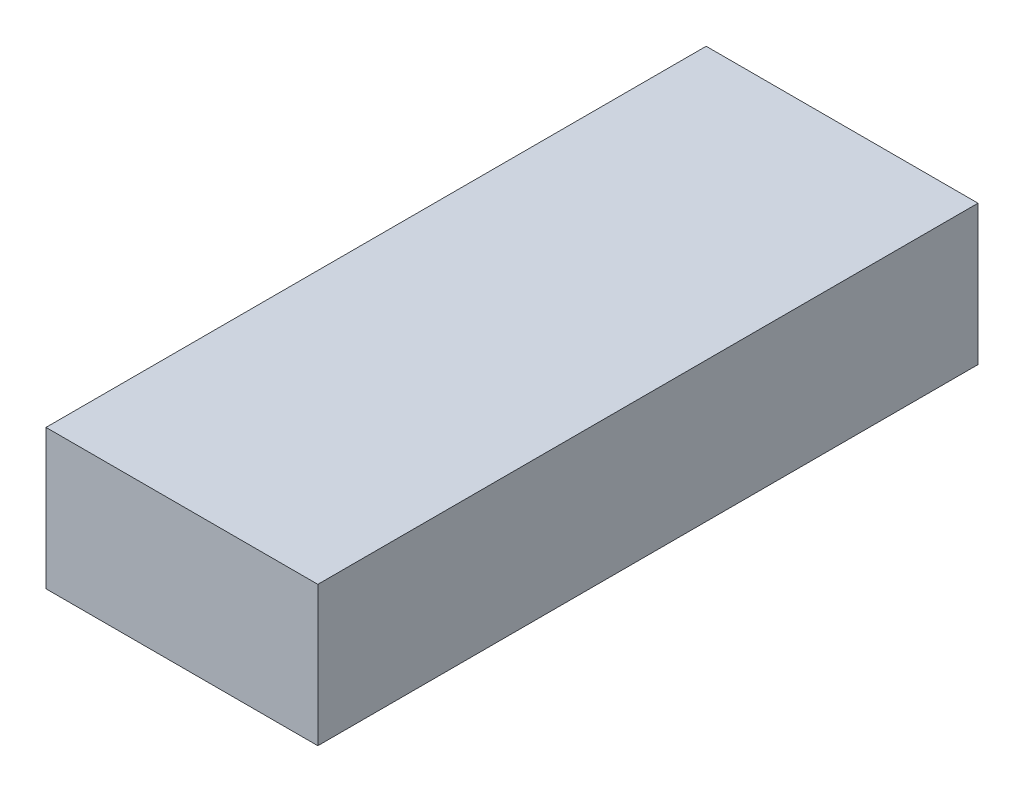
ISO-10303-21;
HEADER;
FILE_DESCRIPTION(('STEP AP214'),'2;1');
FILE_NAME('part.step','',(''),(''),'','','');
FILE_SCHEMA(('AUTOMOTIVE_DESIGN { 1 0 10303 214 1 1 1 1 }'));
ENDSEC;
DATA;
#1=APPLICATION_CONTEXT('core data for automotive mechanical design processes');
#2=APPLICATION_PROTOCOL_DEFINITION('international standard','automotive_design',2000,#1);
#3=PRODUCT_CONTEXT('',#1,'mechanical');
#4=PRODUCT('Part','Part','',(#3));
#5=PRODUCT_RELATED_PRODUCT_CATEGORY('part','',(#4));
#6=PRODUCT_DEFINITION_FORMATION('','',#4);
#7=PRODUCT_DEFINITION_CONTEXT('part definition',#1,'design');
#8=PRODUCT_DEFINITION('design','',#6,#7);
#9=PRODUCT_DEFINITION_SHAPE('','',#8);
#10=(LENGTH_UNIT() NAMED_UNIT(*) SI_UNIT(.MILLI.,.METRE.));
#11=(NAMED_UNIT(*) PLANE_ANGLE_UNIT() SI_UNIT($,.RADIAN.));
#12=(NAMED_UNIT(*) SI_UNIT($,.STERADIAN.) SOLID_ANGLE_UNIT());
#13=UNCERTAINTY_MEASURE_WITH_UNIT(LENGTH_MEASURE(1.E-05),#10,'distance_accuracy_value','');
#14=(GEOMETRIC_REPRESENTATION_CONTEXT(3) GLOBAL_UNCERTAINTY_ASSIGNED_CONTEXT((#13)) GLOBAL_UNIT_ASSIGNED_CONTEXT((#10,
#11,#12)) REPRESENTATION_CONTEXT('',''));
#15=CARTESIAN_POINT('',(0.,0.,0.));
#16=DIRECTION('',(0.,0.,1.));
#17=DIRECTION('',(1.,0.,0.));
#18=AXIS2_PLACEMENT_3D('',#15,#16,#17);
#19=CARTESIAN_POINT('',(17.5,18.,-42.5));
#20=DIRECTION('',(-1.,0.,0.));
#21=DIRECTION('',(0.,0.,1.));
#22=AXIS2_PLACEMENT_3D('',#19,#20,#21);
#23=PLANE('',#22);
#24=DIRECTION('',(0.,0.,-1.));
#25=VECTOR('',#24,1.);
#26=CARTESIAN_POINT('',(17.5,0.,-42.5));
#27=LINE('',#26,#25);
#28=CARTESIAN_POINT('',(17.5,0.,42.5));
#29=VERTEX_POINT('',#28);
#30=CARTESIAN_POINT('',(17.5,0.,-42.5));
#31=VERTEX_POINT('',#30);
#32=EDGE_CURVE('E96',#29,#31,#27,.T.);
#33=ORIENTED_EDGE('',*,*,#32,.T.);
#34=DIRECTION('',(0.,-1.,0.));
#35=VECTOR('',#34,1.);
#36=CARTESIAN_POINT('',(17.5,18.,-42.5));
#37=LINE('',#36,#35);
#38=CARTESIAN_POINT('',(17.5,18.,-42.5));
#39=VERTEX_POINT('',#38);
#40=EDGE_CURVE('E11',#39,#31,#37,.T.);
#41=ORIENTED_EDGE('',*,*,#40,.F.);
#42=DIRECTION('',(0.,0.,-1.));
#43=VECTOR('',#42,1.);
#44=CARTESIAN_POINT('',(17.5,18.,-42.5));
#45=LINE('',#44,#43);
#46=CARTESIAN_POINT('',(17.5,18.,42.5));
#47=VERTEX_POINT('',#46);
#48=EDGE_CURVE('E84',#47,#39,#45,.T.);
#49=ORIENTED_EDGE('',*,*,#48,.F.);
#50=DIRECTION('',(0.,-1.,0.));
#51=VECTOR('',#50,1.);
#52=CARTESIAN_POINT('',(17.5,18.,42.5));
#53=LINE('',#52,#51);
#54=EDGE_CURVE('E92',#47,#29,#53,.T.);
#55=ORIENTED_EDGE('',*,*,#54,.T.);
#56=EDGE_LOOP('',(#33,#41,#49,#55));
#57=FACE_BOUND('',#56,.T.);
#58=ADVANCED_FACE('F33',(#57),#23,.F.);
#59=CARTESIAN_POINT('',(-17.5,18.,-42.5));
#60=DIRECTION('',(0.,0.,1.));
#61=DIRECTION('',(1.,0.,0.));
#62=AXIS2_PLACEMENT_3D('',#59,#60,#61);
#63=PLANE('',#62);
#64=DIRECTION('',(-1.,0.,0.));
#65=VECTOR('',#64,1.);
#66=CARTESIAN_POINT('',(-17.5,0.,-42.5));
#67=LINE('',#66,#65);
#68=CARTESIAN_POINT('',(-17.5,0.,-42.5));
#69=VERTEX_POINT('',#68);
#70=EDGE_CURVE('E88',#31,#69,#67,.T.);
#71=ORIENTED_EDGE('',*,*,#70,.T.);
#72=DIRECTION('',(0.,-1.,0.));
#73=VECTOR('',#72,1.);
#74=CARTESIAN_POINT('',(-17.5,18.,-42.5));
#75=LINE('',#74,#73);
#76=CARTESIAN_POINT('',(-17.5,18.,-42.5));
#77=VERTEX_POINT('',#76);
#78=EDGE_CURVE('E41',#77,#69,#75,.T.);
#79=ORIENTED_EDGE('',*,*,#78,.F.);
#80=DIRECTION('',(-1.,0.,0.));
#81=VECTOR('',#80,1.);
#82=CARTESIAN_POINT('',(-17.5,18.,-42.5));
#83=LINE('',#82,#81);
#84=EDGE_CURVE('E79',#39,#77,#83,.T.);
#85=ORIENTED_EDGE('',*,*,#84,.F.);
#86=ORIENTED_EDGE('',*,*,#40,.T.);
#87=EDGE_LOOP('',(#71,#79,#85,#86));
#88=FACE_BOUND('',#87,.T.);
#89=ADVANCED_FACE('F87',(#88),#63,.F.);
#90=CARTESIAN_POINT('',(-17.5,18.,-42.5));
#91=DIRECTION('',(1.,0.,0.));
#92=DIRECTION('',(0.,0.,-1.));
#93=AXIS2_PLACEMENT_3D('',#90,#91,#92);
#94=PLANE('',#93);
#95=DIRECTION('',(0.,0.,1.));
#96=VECTOR('',#95,1.);
#97=CARTESIAN_POINT('',(-17.5,0.,-42.5));
#98=LINE('',#97,#96);
#99=CARTESIAN_POINT('',(-17.5,0.,42.5));
#100=VERTEX_POINT('',#99);
#101=EDGE_CURVE('E66',#69,#100,#98,.T.);
#102=ORIENTED_EDGE('',*,*,#101,.T.);
#103=DIRECTION('',(0.,-1.,0.));
#104=VECTOR('',#103,1.);
#105=CARTESIAN_POINT('',(-17.5,18.,42.5));
#106=LINE('',#105,#104);
#107=CARTESIAN_POINT('',(-17.5,18.,42.5));
#108=VERTEX_POINT('',#107);
#109=EDGE_CURVE('E89',#108,#100,#106,.T.);
#110=ORIENTED_EDGE('',*,*,#109,.F.);
#111=DIRECTION('',(0.,0.,1.));
#112=VECTOR('',#111,1.);
#113=CARTESIAN_POINT('',(-17.5,18.,-42.5));
#114=LINE('',#113,#112);
#115=EDGE_CURVE('E82',#77,#108,#114,.T.);
#116=ORIENTED_EDGE('',*,*,#115,.F.);
#117=ORIENTED_EDGE('',*,*,#78,.T.);
#118=EDGE_LOOP('',(#102,#110,#116,#117));
#119=FACE_BOUND('',#118,.T.);
#120=ADVANCED_FACE('F90',(#119),#94,.F.);
#121=CARTESIAN_POINT('',(-17.5,18.,42.5));
#122=DIRECTION('',(0.,0.,-1.));
#123=DIRECTION('',(-1.,0.,0.));
#124=AXIS2_PLACEMENT_3D('',#121,#122,#123);
#125=PLANE('',#124);
#126=DIRECTION('',(1.,0.,0.));
#127=VECTOR('',#126,1.);
#128=CARTESIAN_POINT('',(-17.5,0.,42.5));
#129=LINE('',#128,#127);
#130=EDGE_CURVE('E72',#100,#29,#129,.T.);
#131=ORIENTED_EDGE('',*,*,#130,.T.);
#132=ORIENTED_EDGE('',*,*,#54,.F.);
#133=DIRECTION('',(1.,0.,0.));
#134=VECTOR('',#133,1.);
#135=CARTESIAN_POINT('',(-17.5,18.,42.5));
#136=LINE('',#135,#134);
#137=EDGE_CURVE('E49',#108,#47,#136,.T.);
#138=ORIENTED_EDGE('',*,*,#137,.F.);
#139=ORIENTED_EDGE('',*,*,#109,.T.);
#140=EDGE_LOOP('',(#131,#132,#138,#139));
#141=FACE_BOUND('',#140,.T.);
#142=ADVANCED_FACE('F103',(#141),#125,.F.);
#143=CARTESIAN_POINT('',(0.,18.,0.));
#144=DIRECTION('',(0.,1.,0.));
#145=DIRECTION('',(0.,0.,1.));
#146=AXIS2_PLACEMENT_3D('',#143,#144,#145);
#147=PLANE('',#146);
#148=ORIENTED_EDGE('',*,*,#48,.T.);
#149=ORIENTED_EDGE('',*,*,#84,.T.);
#150=ORIENTED_EDGE('',*,*,#115,.T.);
#151=ORIENTED_EDGE('',*,*,#137,.T.);
#152=EDGE_LOOP('',(#148,#149,#150,#151));
#153=FACE_BOUND('',#152,.T.);
#154=ADVANCED_FACE('F80',(#153),#147,.T.);
#155=CARTESIAN_POINT('',(0.,0.,0.));
#156=DIRECTION('',(0.,1.,0.));
#157=DIRECTION('',(0.,0.,1.));
#158=AXIS2_PLACEMENT_3D('',#155,#156,#157);
#159=PLANE('',#158);
#160=ORIENTED_EDGE('',*,*,#32,.F.);
#161=ORIENTED_EDGE('',*,*,#130,.F.);
#162=ORIENTED_EDGE('',*,*,#101,.F.);
#163=ORIENTED_EDGE('',*,*,#70,.F.);
#164=EDGE_LOOP('',(#160,#161,#162,#163));
#165=FACE_BOUND('',#164,.T.);
#166=ADVANCED_FACE('F106',(#165),#159,.F.);
#167=CLOSED_SHELL('',(#58,#89,#120,#142,#154,#166));
#168=MANIFOLD_SOLID_BREP('B2',#167);
#169=ADVANCED_BREP_SHAPE_REPRESENTATION('',(#18,#168),#14);
#170=SHAPE_DEFINITION_REPRESENTATION(#9,#169);
ENDSEC;
END-ISO-10303-21;
